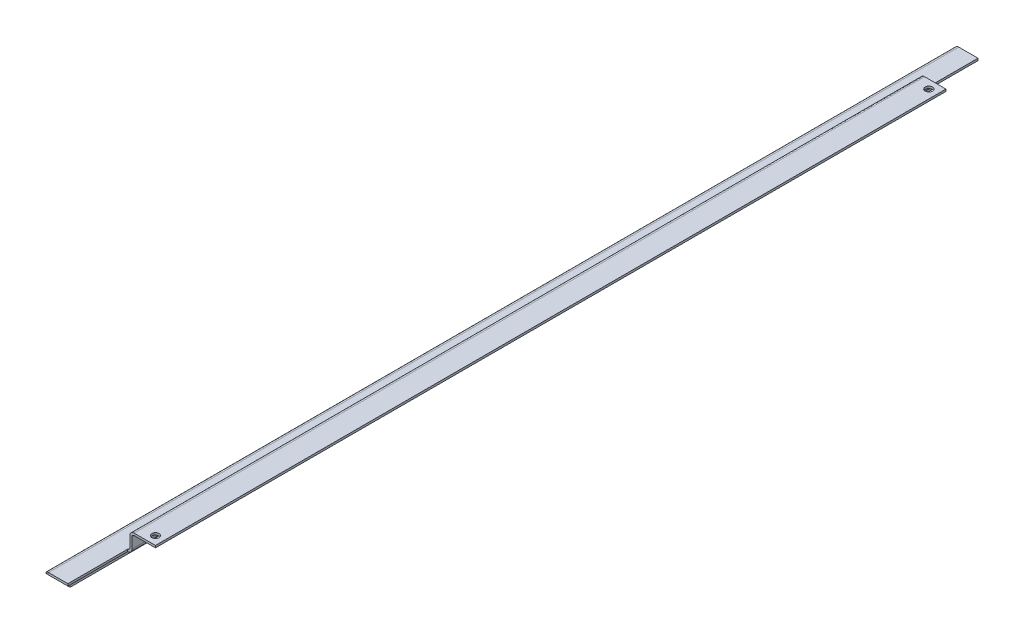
ISO-10303-21;
HEADER;
FILE_DESCRIPTION(('STEP AP214'),'2;1');
FILE_NAME('part.step','',(''),(''),'','','');
FILE_SCHEMA(('AUTOMOTIVE_DESIGN { 1 0 10303 214 1 1 1 1 }'));
ENDSEC;
DATA;
#1=APPLICATION_CONTEXT('core data for automotive mechanical design processes');
#2=APPLICATION_PROTOCOL_DEFINITION('international standard','automotive_design',2000,#1);
#3=PRODUCT_CONTEXT('',#1,'mechanical');
#4=PRODUCT('Part','Part','',(#3));
#5=PRODUCT_RELATED_PRODUCT_CATEGORY('part','',(#4));
#6=PRODUCT_DEFINITION_FORMATION('','',#4);
#7=PRODUCT_DEFINITION_CONTEXT('part definition',#1,'design');
#8=PRODUCT_DEFINITION('design','',#6,#7);
#9=PRODUCT_DEFINITION_SHAPE('','',#8);
#10=(LENGTH_UNIT() NAMED_UNIT(*) SI_UNIT(.MILLI.,.METRE.));
#11=(NAMED_UNIT(*) PLANE_ANGLE_UNIT() SI_UNIT($,.RADIAN.));
#12=(NAMED_UNIT(*) SI_UNIT($,.STERADIAN.) SOLID_ANGLE_UNIT());
#13=UNCERTAINTY_MEASURE_WITH_UNIT(LENGTH_MEASURE(1.E-05),#10,'distance_accuracy_value','');
#14=(GEOMETRIC_REPRESENTATION_CONTEXT(3) GLOBAL_UNCERTAINTY_ASSIGNED_CONTEXT((#13)) GLOBAL_UNIT_ASSIGNED_CONTEXT((#10,
#11,#12)) REPRESENTATION_CONTEXT('',''));
#15=CARTESIAN_POINT('',(0.,0.,0.));
#16=DIRECTION('',(0.,0.,1.));
#17=DIRECTION('',(1.,0.,0.));
#18=AXIS2_PLACEMENT_3D('',#15,#16,#17);
#19=CARTESIAN_POINT('',(5.,25.0000000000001,532.5));
#20=DIRECTION('',(0.,0.,-1.));
#21=DIRECTION('',(-1.,0.,0.));
#22=AXIS2_PLACEMENT_3D('',#19,#20,#21);
#23=CYLINDRICAL_SURFACE('',#22,5.);
#24=DIRECTION('',(0.,0.,-1.));
#25=VECTOR('',#24,1.);
#26=CARTESIAN_POINT('',(0.,25.0000000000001,532.5));
#27=LINE('',#26,#25);
#28=CARTESIAN_POINT('',(0.,25.0000000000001,530.));
#29=VERTEX_POINT('',#28);
#30=CARTESIAN_POINT('',(0.,25.0000000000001,-530.));
#31=VERTEX_POINT('',#30);
#32=EDGE_CURVE('E266',#29,#31,#27,.T.);
#33=ORIENTED_EDGE('',*,*,#32,.F.);
#34=CARTESIAN_POINT('',(5.,25.0000000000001,530.));
#35=DIRECTION('',(0.,0.44721359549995,-0.89442719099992));
#36=DIRECTION('',(0.,-0.89442719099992,-0.44721359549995));
#37=AXIS2_PLACEMENT_3D('',#34,#35,#36);
#38=ELLIPSE('',#37,5.59016994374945,5.);
#39=CARTESIAN_POINT('',(5.,30.,532.5));
#40=VERTEX_POINT('',#39);
#41=EDGE_CURVE('E333',#40,#29,#38,.F.);
#42=ORIENTED_EDGE('',*,*,#41,.F.);
#43=DIRECTION('',(0.,0.,-1.));
#44=VECTOR('',#43,1.);
#45=CARTESIAN_POINT('',(5.,30.,532.5));
#46=LINE('',#45,#44);
#47=CARTESIAN_POINT('',(5.,30.,-532.5));
#48=VERTEX_POINT('',#47);
#49=EDGE_CURVE('E269',#40,#48,#46,.T.);
#50=ORIENTED_EDGE('',*,*,#49,.T.);
#51=CARTESIAN_POINT('',(5.,24.9999999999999,-530.));
#52=DIRECTION('',(0.,0.44721359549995,0.89442719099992));
#53=DIRECTION('',(0.,0.89442719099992,-0.44721359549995));
#54=AXIS2_PLACEMENT_3D('',#51,#52,#53);
#55=ELLIPSE('',#54,5.59016994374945,5.);
#56=EDGE_CURVE('E354',#31,#48,#55,.F.);
#57=ORIENTED_EDGE('',*,*,#56,.F.);
#58=EDGE_LOOP('',(#33,#42,#50,#57));
#59=FACE_BOUND('',#58,.T.);
#60=ADVANCED_FACE('F42',(#59),#23,.T.);
#61=CARTESIAN_POINT('',(0.,0.,532.5));
#62=DIRECTION('',(-1.,0.,0.));
#63=DIRECTION('',(0.,0.,1.));
#64=AXIS2_PLACEMENT_3D('',#61,#62,#63);
#65=PLANE('',#64);
#66=DIRECTION('',(0.,0.,-1.));
#67=VECTOR('',#66,1.);
#68=CARTESIAN_POINT('',(0.,0.,532.5));
#69=LINE('',#68,#67);
#70=CARTESIAN_POINT('',(0.,0.,505.));
#71=VERTEX_POINT('',#70);
#72=CARTESIAN_POINT('',(0.,0.,-505.));
#73=VERTEX_POINT('',#72);
#74=EDGE_CURVE('E263',#71,#73,#69,.T.);
#75=ORIENTED_EDGE('',*,*,#74,.F.);
#76=DIRECTION('',(0.,-0.707106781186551,-0.707106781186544));
#77=VECTOR('',#76,1.);
#78=CARTESIAN_POINT('',(0.,13.7499999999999,518.75));
#79=LINE('',#78,#77);
#80=EDGE_CURVE('E339',#29,#71,#79,.T.);
#81=ORIENTED_EDGE('',*,*,#80,.F.);
#82=ORIENTED_EDGE('',*,*,#32,.T.);
#83=DIRECTION('',(0.,0.707106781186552,-0.707106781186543));
#84=VECTOR('',#83,1.);
#85=CARTESIAN_POINT('',(0.,0.,-505.));
#86=LINE('',#85,#84);
#87=EDGE_CURVE('E357',#73,#31,#86,.T.);
#88=ORIENTED_EDGE('',*,*,#87,.F.);
#89=EDGE_LOOP('',(#75,#81,#82,#88));
#90=FACE_BOUND('',#89,.T.);
#91=ADVANCED_FACE('F458',(#90),#65,.T.);
#92=CARTESIAN_POINT('',(2.49999999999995,0.,532.5));
#93=DIRECTION('',(0.,-1.,0.));
#94=DIRECTION('',(0.,0.,-1.));
#95=AXIS2_PLACEMENT_3D('',#92,#93,#94);
#96=PLANE('',#95);
#97=DIRECTION('',(0.,0.,-1.));
#98=VECTOR('',#97,1.);
#99=CARTESIAN_POINT('',(2.49999999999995,0.,532.5));
#100=LINE('',#99,#98);
#101=CARTESIAN_POINT('',(2.50000000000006,0.,505.));
#102=VERTEX_POINT('',#101);
#103=CARTESIAN_POINT('',(2.49999999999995,0.,-505.));
#104=VERTEX_POINT('',#103);
#105=EDGE_CURVE('E260',#102,#104,#100,.T.);
#106=ORIENTED_EDGE('',*,*,#105,.F.);
#107=DIRECTION('',(1.,0.,0.));
#108=VECTOR('',#107,1.);
#109=CARTESIAN_POINT('',(2.50000000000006,0.,505.));
#110=LINE('',#109,#108);
#111=EDGE_CURVE('E343',#102,#71,#110,.F.);
#112=ORIENTED_EDGE('',*,*,#111,.T.);
#113=ORIENTED_EDGE('',*,*,#74,.T.);
#114=DIRECTION('',(-1.,0.,0.));
#115=VECTOR('',#114,1.);
#116=CARTESIAN_POINT('',(0.,0.,-505.));
#117=LINE('',#116,#115);
#118=EDGE_CURVE('E364',#73,#104,#117,.F.);
#119=ORIENTED_EDGE('',*,*,#118,.T.);
#120=EDGE_LOOP('',(#106,#112,#113,#119));
#121=FACE_BOUND('',#120,.T.);
#122=ADVANCED_FACE('F455',(#121),#96,.T.);
#123=CARTESIAN_POINT('',(2.49999999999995,0.,532.5));
#124=DIRECTION('',(-1.,0.,0.));
#125=DIRECTION('',(0.,0.,1.));
#126=AXIS2_PLACEMENT_3D('',#123,#124,#125);
#127=PLANE('',#126);
#128=DIRECTION('',(0.,-0.707106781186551,-0.707106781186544));
#129=VECTOR('',#128,1.);
#130=CARTESIAN_POINT('',(2.49999999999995,13.7499999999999,518.75));
#131=LINE('',#130,#129);
#132=CARTESIAN_POINT('',(2.49999999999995,25.0000000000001,530.));
#133=VERTEX_POINT('',#132);
#134=EDGE_CURVE('E335',#133,#102,#131,.T.);
#135=ORIENTED_EDGE('',*,*,#134,.T.);
#136=ORIENTED_EDGE('',*,*,#105,.T.);
#137=DIRECTION('',(0.,0.707106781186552,-0.707106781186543));
#138=VECTOR('',#137,1.);
#139=CARTESIAN_POINT('',(2.49999999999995,0.,-505.));
#140=LINE('',#139,#138);
#141=CARTESIAN_POINT('',(2.49999999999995,24.9999999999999,-530.));
#142=VERTEX_POINT('',#141);
#143=EDGE_CURVE('E360',#104,#142,#140,.T.);
#144=ORIENTED_EDGE('',*,*,#143,.T.);
#145=DIRECTION('',(0.,0.,-1.));
#146=VECTOR('',#145,1.);
#147=CARTESIAN_POINT('',(2.49999999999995,25.0000000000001,532.5));
#148=LINE('',#147,#146);
#149=EDGE_CURVE('E257',#133,#142,#148,.T.);
#150=ORIENTED_EDGE('',*,*,#149,.F.);
#151=EDGE_LOOP('',(#135,#136,#144,#150));
#152=FACE_BOUND('',#151,.T.);
#153=ADVANCED_FACE('F451',(#152),#127,.F.);
#154=CARTESIAN_POINT('',(5.,25.0000000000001,532.5));
#155=DIRECTION('',(0.,0.,-1.));
#156=DIRECTION('',(-1.,0.,0.));
#157=AXIS2_PLACEMENT_3D('',#154,#155,#156);
#158=CYLINDRICAL_SURFACE('',#157,2.5);
#159=CARTESIAN_POINT('',(5.,25.0000000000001,530.));
#160=DIRECTION('',(0.,0.707106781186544,-0.707106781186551));
#161=DIRECTION('',(0.,-0.707106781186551,-0.707106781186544));
#162=AXIS2_PLACEMENT_3D('',#159,#160,#161);
#163=ELLIPSE('',#162,3.53553390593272,2.5);
#164=CARTESIAN_POINT('',(5.,27.5000000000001,532.5));
#165=VERTEX_POINT('',#164);
#166=EDGE_CURVE('E329',#165,#133,#163,.F.);
#167=ORIENTED_EDGE('',*,*,#166,.T.);
#168=ORIENTED_EDGE('',*,*,#149,.T.);
#169=CARTESIAN_POINT('',(5.,24.9999999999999,-530.));
#170=DIRECTION('',(0.,0.707106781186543,0.707106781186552));
#171=DIRECTION('',(0.,0.707106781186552,-0.707106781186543));
#172=AXIS2_PLACEMENT_3D('',#169,#170,#171);
#173=ELLIPSE('',#172,3.53553390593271,2.5);
#174=CARTESIAN_POINT('',(5.,27.4999999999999,-532.5));
#175=VERTEX_POINT('',#174);
#176=EDGE_CURVE('E347',#142,#175,#173,.F.);
#177=ORIENTED_EDGE('',*,*,#176,.T.);
#178=DIRECTION('',(0.,0.,-1.));
#179=VECTOR('',#178,1.);
#180=CARTESIAN_POINT('',(5.,27.5000000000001,532.5));
#181=LINE('',#180,#179);
#182=EDGE_CURVE('E252',#165,#175,#181,.T.);
#183=ORIENTED_EDGE('',*,*,#182,.F.);
#184=EDGE_LOOP('',(#167,#168,#177,#183));
#185=FACE_BOUND('',#184,.T.);
#186=ADVANCED_FACE('F438',(#185),#158,.F.);
#187=CARTESIAN_POINT('',(2.49999999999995,25.0000000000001,532.5));
#188=DIRECTION('',(0.,0.,1.));
#189=DIRECTION('',(1.,0.,0.));
#190=AXIS2_PLACEMENT_3D('',#187,#188,#189);
#191=PLANE('',#190);
#192=DIRECTION('',(1.,0.,0.));
#193=VECTOR('',#192,1.);
#194=CARTESIAN_POINT('',(0.,30.,532.5));
#195=LINE('',#194,#193);
#196=CARTESIAN_POINT('',(27.5,30.,532.5));
#197=VERTEX_POINT('',#196);
#198=EDGE_CURVE('E380',#40,#197,#195,.T.);
#199=ORIENTED_EDGE('',*,*,#198,.F.);
#200=DIRECTION('',(0.,-1.,0.));
#201=VECTOR('',#200,1.);
#202=CARTESIAN_POINT('',(5.,30.,532.5));
#203=LINE('',#202,#201);
#204=EDGE_CURVE('E217',#40,#165,#203,.T.);
#205=ORIENTED_EDGE('',*,*,#204,.T.);
#206=DIRECTION('',(1.,0.,0.));
#207=VECTOR('',#206,1.);
#208=CARTESIAN_POINT('',(0.,27.5000000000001,532.5));
#209=LINE('',#208,#207);
#210=CARTESIAN_POINT('',(27.5,27.5000000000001,532.5));
#211=VERTEX_POINT('',#210);
#212=EDGE_CURVE('E245',#165,#211,#209,.T.);
#213=ORIENTED_EDGE('',*,*,#212,.T.);
#214=DIRECTION('',(0.,1.,0.));
#215=VECTOR('',#214,1.);
#216=CARTESIAN_POINT('',(27.5,27.5000000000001,532.5));
#217=LINE('',#216,#215);
#218=EDGE_CURVE('E209',#211,#197,#217,.T.);
#219=ORIENTED_EDGE('',*,*,#218,.T.);
#220=EDGE_LOOP('',(#199,#205,#213,#219));
#221=FACE_BOUND('',#220,.T.);
#222=ADVANCED_FACE('F44',(#221),#191,.T.);
#223=CARTESIAN_POINT('',(32.5,32.5,-532.5));
#224=DIRECTION('',(0.,0.,-1.));
#225=DIRECTION('',(-1.,0.,0.));
#226=AXIS2_PLACEMENT_3D('',#223,#224,#225);
#227=PLANE('',#226);
#228=DIRECTION('',(1.,0.,0.));
#229=VECTOR('',#228,1.);
#230=CARTESIAN_POINT('',(0.,30.,-532.5));
#231=LINE('',#230,#229);
#232=CARTESIAN_POINT('',(27.5,30.,-532.5));
#233=VERTEX_POINT('',#232);
#234=EDGE_CURVE('E369',#48,#233,#231,.T.);
#235=ORIENTED_EDGE('',*,*,#234,.T.);
#236=DIRECTION('',(0.,-1.,0.));
#237=VECTOR('',#236,1.);
#238=CARTESIAN_POINT('',(27.5,30.,-532.5));
#239=LINE('',#238,#237);
#240=CARTESIAN_POINT('',(27.5,27.4999999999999,-532.5));
#241=VERTEX_POINT('',#240);
#242=EDGE_CURVE('E199',#233,#241,#239,.T.);
#243=ORIENTED_EDGE('',*,*,#242,.T.);
#244=DIRECTION('',(1.,0.,0.));
#245=VECTOR('',#244,1.);
#246=CARTESIAN_POINT('',(0.,27.4999999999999,-532.5));
#247=LINE('',#246,#245);
#248=EDGE_CURVE('E376',#175,#241,#247,.T.);
#249=ORIENTED_EDGE('',*,*,#248,.F.);
#250=DIRECTION('',(0.,1.,0.));
#251=VECTOR('',#250,1.);
#252=CARTESIAN_POINT('',(5.,27.4999999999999,-532.5));
#253=LINE('',#252,#251);
#254=EDGE_CURVE('E213',#175,#48,#253,.T.);
#255=ORIENTED_EDGE('',*,*,#254,.T.);
#256=EDGE_LOOP('',(#235,#243,#249,#255));
#257=FACE_BOUND('',#256,.T.);
#258=ADVANCED_FACE('F436',(#257),#227,.T.);
#259=CARTESIAN_POINT('',(30.,47.5000000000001,532.5));
#260=DIRECTION('',(0.,1.,0.));
#261=DIRECTION('',(0.,0.,1.));
#262=AXIS2_PLACEMENT_3D('',#259,#260,#261);
#263=PLANE('',#262);
#264=CARTESIAN_POINT('',(49.9999999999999,47.4999999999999,-452.5));
#265=DIRECTION('',(0.,1.,0.));
#266=DIRECTION('',(0.,0.,1.));
#267=AXIS2_PLACEMENT_3D('',#264,#265,#266);
#268=CIRCLE('',#267,4.24999999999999);
#269=CARTESIAN_POINT('',(49.9999999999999,47.4999999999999,-448.25));
#270=VERTEX_POINT('',#269);
#271=EDGE_CURVE('E423',#270,#270,#268,.T.);
#272=ORIENTED_EDGE('',*,*,#271,.T.);
#273=EDGE_LOOP('',(#272));
#274=FACE_BOUND('',#273,.T.);
#275=CARTESIAN_POINT('',(49.9999999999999,47.5000000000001,452.5));
#276=DIRECTION('',(0.,1.,0.));
#277=DIRECTION('',(0.,0.,1.));
#278=AXIS2_PLACEMENT_3D('',#275,#276,#277);
#279=CIRCLE('',#278,4.24999999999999);
#280=CARTESIAN_POINT('',(49.9999999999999,47.5000000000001,456.75));
#281=VERTEX_POINT('',#280);
#282=EDGE_CURVE('E188',#281,#281,#279,.T.);
#283=ORIENTED_EDGE('',*,*,#282,.T.);
#284=EDGE_LOOP('',(#283));
#285=FACE_BOUND('',#284,.T.);
#286=DIRECTION('',(0.,0.,-1.));
#287=VECTOR('',#286,1.);
#288=CARTESIAN_POINT('',(35.,47.5000000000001,532.5));
#289=LINE('',#288,#287);
#290=CARTESIAN_POINT('',(35.,47.5000000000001,462.5));
#291=VERTEX_POINT('',#290);
#292=CARTESIAN_POINT('',(35.,47.4999999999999,-462.5));
#293=VERTEX_POINT('',#292);
#294=EDGE_CURVE('E230',#291,#293,#289,.T.);
#295=ORIENTED_EDGE('',*,*,#294,.T.);
#296=DIRECTION('',(1.,0.,0.));
#297=VECTOR('',#296,1.);
#298=CARTESIAN_POINT('',(30.,47.4999999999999,-462.5));
#299=LINE('',#298,#297);
#300=CARTESIAN_POINT('',(59.9999999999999,47.4999999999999,-462.5));
#301=VERTEX_POINT('',#300);
#302=EDGE_CURVE('E58',#293,#301,#299,.T.);
#303=ORIENTED_EDGE('',*,*,#302,.T.);
#304=DIRECTION('',(0.,0.,-1.));
#305=VECTOR('',#304,1.);
#306=CARTESIAN_POINT('',(59.9999999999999,47.5000000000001,532.5));
#307=LINE('',#306,#305);
#308=CARTESIAN_POINT('',(59.9999999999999,47.5000000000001,462.5));
#309=VERTEX_POINT('',#308);
#310=EDGE_CURVE('E186',#309,#301,#307,.T.);
#311=ORIENTED_EDGE('',*,*,#310,.F.);
#312=DIRECTION('',(-1.,0.,0.));
#313=VECTOR('',#312,1.);
#314=CARTESIAN_POINT('',(30.,47.5000000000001,462.5));
#315=LINE('',#314,#313);
#316=EDGE_CURVE('E321',#309,#291,#315,.T.);
#317=ORIENTED_EDGE('',*,*,#316,.T.);
#318=EDGE_LOOP('',(#295,#303,#311,#317));
#319=FACE_BOUND('',#318,.T.);
#320=ADVANCED_FACE('F497',(#274,#285,#319),#263,.F.);
#321=CARTESIAN_POINT('',(59.9999999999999,50.,532.5));
#322=DIRECTION('',(1.,0.,0.));
#323=DIRECTION('',(0.,0.,-1.));
#324=AXIS2_PLACEMENT_3D('',#321,#322,#323);
#325=PLANE('',#324);
#326=DIRECTION('',(0.,-1.,0.));
#327=VECTOR('',#326,1.);
#328=CARTESIAN_POINT('',(59.9999999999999,50.,-462.5));
#329=LINE('',#328,#327);
#330=CARTESIAN_POINT('',(59.9999999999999,50.,-462.5));
#331=VERTEX_POINT('',#330);
#332=EDGE_CURVE('E168',#331,#301,#329,.T.);
#333=ORIENTED_EDGE('',*,*,#332,.F.);
#334=DIRECTION('',(0.,0.,-1.));
#335=VECTOR('',#334,1.);
#336=CARTESIAN_POINT('',(59.9999999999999,50.,532.5));
#337=LINE('',#336,#335);
#338=CARTESIAN_POINT('',(59.9999999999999,50.,462.5));
#339=VERTEX_POINT('',#338);
#340=EDGE_CURVE('E184',#339,#331,#337,.T.);
#341=ORIENTED_EDGE('',*,*,#340,.F.);
#342=DIRECTION('',(0.,1.,0.));
#343=VECTOR('',#342,1.);
#344=CARTESIAN_POINT('',(59.9999999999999,50.,462.5));
#345=LINE('',#344,#343);
#346=EDGE_CURVE('E302',#309,#339,#345,.T.);
#347=ORIENTED_EDGE('',*,*,#346,.F.);
#348=ORIENTED_EDGE('',*,*,#310,.T.);
#349=EDGE_LOOP('',(#333,#341,#347,#348));
#350=FACE_BOUND('',#349,.T.);
#351=ADVANCED_FACE('F182',(#350),#325,.T.);
#352=CARTESIAN_POINT('',(30.,50.,532.5));
#353=DIRECTION('',(0.,1.,0.));
#354=DIRECTION('',(0.,0.,1.));
#355=AXIS2_PLACEMENT_3D('',#352,#353,#354);
#356=PLANE('',#355);
#357=CARTESIAN_POINT('',(49.9999999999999,50.,-452.5));
#358=DIRECTION('',(0.,1.,0.));
#359=DIRECTION('',(0.,0.,1.));
#360=AXIS2_PLACEMENT_3D('',#357,#358,#359);
#361=CIRCLE('',#360,4.24999999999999);
#362=CARTESIAN_POINT('',(49.9999999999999,50.,-448.25));
#363=VERTEX_POINT('',#362);
#364=EDGE_CURVE('E426',#363,#363,#361,.T.);
#365=ORIENTED_EDGE('',*,*,#364,.F.);
#366=EDGE_LOOP('',(#365));
#367=FACE_BOUND('',#366,.T.);
#368=CARTESIAN_POINT('',(49.9999999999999,50.,452.5));
#369=DIRECTION('',(0.,1.,0.));
#370=DIRECTION('',(0.,0.,1.));
#371=AXIS2_PLACEMENT_3D('',#368,#369,#370);
#372=CIRCLE('',#371,4.24999999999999);
#373=CARTESIAN_POINT('',(49.9999999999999,50.,456.75));
#374=VERTEX_POINT('',#373);
#375=EDGE_CURVE('E425',#374,#374,#372,.T.);
#376=ORIENTED_EDGE('',*,*,#375,.F.);
#377=EDGE_LOOP('',(#376));
#378=FACE_BOUND('',#377,.T.);
#379=DIRECTION('',(1.,0.,0.));
#380=VECTOR('',#379,1.);
#381=CARTESIAN_POINT('',(27.5,50.,-462.5));
#382=LINE('',#381,#380);
#383=CARTESIAN_POINT('',(35.,50.,-462.5));
#384=VERTEX_POINT('',#383);
#385=EDGE_CURVE('E165',#384,#331,#382,.T.);
#386=ORIENTED_EDGE('',*,*,#385,.F.);
#387=DIRECTION('',(0.,0.,-1.));
#388=VECTOR('',#387,1.);
#389=CARTESIAN_POINT('',(35.,50.,532.5));
#390=LINE('',#389,#388);
#391=CARTESIAN_POINT('',(35.,50.,462.5));
#392=VERTEX_POINT('',#391);
#393=EDGE_CURVE('E194',#392,#384,#390,.T.);
#394=ORIENTED_EDGE('',*,*,#393,.F.);
#395=DIRECTION('',(1.,0.,0.));
#396=VECTOR('',#395,1.);
#397=CARTESIAN_POINT('',(27.5,50.,462.5));
#398=LINE('',#397,#396);
#399=EDGE_CURVE('E192',#392,#339,#398,.T.);
#400=ORIENTED_EDGE('',*,*,#399,.T.);
#401=ORIENTED_EDGE('',*,*,#340,.T.);
#402=EDGE_LOOP('',(#386,#394,#400,#401));
#403=FACE_BOUND('',#402,.T.);
#404=ADVANCED_FACE('F191',(#367,#378,#403),#356,.T.);
#405=CARTESIAN_POINT('',(35.,45.0000000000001,532.5));
#406=DIRECTION('',(0.,0.,-1.));
#407=DIRECTION('',(-1.,0.,0.));
#408=AXIS2_PLACEMENT_3D('',#405,#406,#407);
#409=CYLINDRICAL_SURFACE('',#408,5.);
#410=CARTESIAN_POINT('',(35.,44.9999999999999,-462.5));
#411=DIRECTION('',(0.,0.,1.));
#412=DIRECTION('',(1.,0.,0.));
#413=AXIS2_PLACEMENT_3D('',#410,#411,#412);
#414=CIRCLE('',#413,5.);
#415=CARTESIAN_POINT('',(30.,44.9999999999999,-462.5));
#416=VERTEX_POINT('',#415);
#417=EDGE_CURVE('E170',#416,#384,#414,.F.);
#418=ORIENTED_EDGE('',*,*,#417,.F.);
#419=DIRECTION('',(0.,0.,-1.));
#420=VECTOR('',#419,1.);
#421=CARTESIAN_POINT('',(30.,45.0000000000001,532.5));
#422=LINE('',#421,#420);
#423=CARTESIAN_POINT('',(30.,45.0000000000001,462.5));
#424=VERTEX_POINT('',#423);
#425=EDGE_CURVE('E202',#424,#416,#422,.T.);
#426=ORIENTED_EDGE('',*,*,#425,.F.);
#427=CARTESIAN_POINT('',(35.,45.0000000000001,462.5));
#428=DIRECTION('',(0.,0.,-1.));
#429=DIRECTION('',(-1.,0.,0.));
#430=AXIS2_PLACEMENT_3D('',#427,#428,#429);
#431=CIRCLE('',#430,5.);
#432=EDGE_CURVE('E296',#392,#424,#431,.F.);
#433=ORIENTED_EDGE('',*,*,#432,.F.);
#434=ORIENTED_EDGE('',*,*,#393,.T.);
#435=EDGE_LOOP('',(#418,#426,#433,#434));
#436=FACE_BOUND('',#435,.T.);
#437=ADVANCED_FACE('F295',(#436),#409,.T.);
#438=CARTESIAN_POINT('',(30.,30.,532.5));
#439=DIRECTION('',(-1.,0.,0.));
#440=DIRECTION('',(0.,0.,1.));
#441=AXIS2_PLACEMENT_3D('',#438,#439,#440);
#442=PLANE('',#441);
#443=DIRECTION('',(0.,1.,0.));
#444=VECTOR('',#443,1.);
#445=CARTESIAN_POINT('',(30.,30.,-462.5));
#446=LINE('',#445,#444);
#447=CARTESIAN_POINT('',(30.,32.5,-462.5));
#448=VERTEX_POINT('',#447);
#449=EDGE_CURVE('E291',#448,#416,#446,.T.);
#450=ORIENTED_EDGE('',*,*,#449,.F.);
#451=DIRECTION('',(0.,0.,-1.));
#452=VECTOR('',#451,1.);
#453=CARTESIAN_POINT('',(30.,32.5,532.5));
#454=LINE('',#453,#452);
#455=CARTESIAN_POINT('',(30.,32.5,462.5));
#456=VERTEX_POINT('',#455);
#457=EDGE_CURVE('E278',#456,#448,#454,.T.);
#458=ORIENTED_EDGE('',*,*,#457,.F.);
#459=DIRECTION('',(0.,-1.,0.));
#460=VECTOR('',#459,1.);
#461=CARTESIAN_POINT('',(30.,30.,462.5));
#462=LINE('',#461,#460);
#463=EDGE_CURVE('E292',#424,#456,#462,.T.);
#464=ORIENTED_EDGE('',*,*,#463,.F.);
#465=ORIENTED_EDGE('',*,*,#425,.T.);
#466=EDGE_LOOP('',(#450,#458,#464,#465));
#467=FACE_BOUND('',#466,.T.);
#468=ADVANCED_FACE('F289',(#467),#442,.T.);
#469=CARTESIAN_POINT('',(27.5,32.5,532.5));
#470=DIRECTION('',(0.,0.,-1.));
#471=DIRECTION('',(-1.,0.,0.));
#472=AXIS2_PLACEMENT_3D('',#469,#470,#471);
#473=CYLINDRICAL_SURFACE('',#472,2.5);
#474=CARTESIAN_POINT('',(27.5,32.5,-462.5));
#475=DIRECTION('',(0.,0.,1.));
#476=DIRECTION('',(1.,0.,0.));
#477=AXIS2_PLACEMENT_3D('',#474,#475,#476);
#478=CIRCLE('',#477,2.5);
#479=CARTESIAN_POINT('',(27.5,30.,-462.5));
#480=VERTEX_POINT('',#479);
#481=EDGE_CURVE('E304',#480,#448,#478,.T.);
#482=ORIENTED_EDGE('',*,*,#481,.F.);
#483=DIRECTION('',(0.,0.,-1.));
#484=VECTOR('',#483,1.);
#485=CARTESIAN_POINT('',(27.5,30.,532.5));
#486=LINE('',#485,#484);
#487=CARTESIAN_POINT('',(27.5,30.,462.5));
#488=VERTEX_POINT('',#487);
#489=EDGE_CURVE('E273',#488,#480,#486,.T.);
#490=ORIENTED_EDGE('',*,*,#489,.F.);
#491=CARTESIAN_POINT('',(27.5,32.5,462.5));
#492=DIRECTION('',(0.,0.,-1.));
#493=DIRECTION('',(-1.,0.,0.));
#494=AXIS2_PLACEMENT_3D('',#491,#492,#493);
#495=CIRCLE('',#494,2.5);
#496=EDGE_CURVE('E323',#456,#488,#495,.T.);
#497=ORIENTED_EDGE('',*,*,#496,.F.);
#498=ORIENTED_EDGE('',*,*,#457,.T.);
#499=EDGE_LOOP('',(#482,#490,#497,#498));
#500=FACE_BOUND('',#499,.T.);
#501=ADVANCED_FACE('F416',(#500),#473,.F.);
#502=CARTESIAN_POINT('',(0.,30.,532.5));
#503=DIRECTION('',(0.,1.,0.));
#504=DIRECTION('',(0.,0.,1.));
#505=AXIS2_PLACEMENT_3D('',#502,#503,#504);
#506=PLANE('',#505);
#507=ORIENTED_EDGE('',*,*,#234,.F.);
#508=ORIENTED_EDGE('',*,*,#49,.F.);
#509=ORIENTED_EDGE('',*,*,#198,.T.);
#510=EDGE_CURVE('E274',#197,#488,#486,.T.);
#511=ORIENTED_EDGE('',*,*,#510,.T.);
#512=ORIENTED_EDGE('',*,*,#489,.T.);
#513=DIRECTION('',(0.,0.,1.));
#514=VECTOR('',#513,1.);
#515=CARTESIAN_POINT('',(27.5,30.,532.5));
#516=LINE('',#515,#514);
#517=EDGE_CURVE('E298',#233,#480,#516,.T.);
#518=ORIENTED_EDGE('',*,*,#517,.F.);
#519=EDGE_LOOP('',(#507,#508,#509,#511,#512,#518));
#520=FACE_BOUND('',#519,.T.);
#521=ADVANCED_FACE('F420',(#520),#506,.T.);
#522=CARTESIAN_POINT('',(0.,27.5000000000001,532.5));
#523=DIRECTION('',(0.,1.,0.));
#524=DIRECTION('',(0.,0.,1.));
#525=AXIS2_PLACEMENT_3D('',#522,#523,#524);
#526=PLANE('',#525);
#527=ORIENTED_EDGE('',*,*,#248,.T.);
#528=DIRECTION('',(0.,0.,-1.));
#529=VECTOR('',#528,1.);
#530=CARTESIAN_POINT('',(27.5,27.5000000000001,532.5));
#531=LINE('',#530,#529);
#532=CARTESIAN_POINT('',(27.5,27.5000000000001,-462.5));
#533=VERTEX_POINT('',#532);
#534=EDGE_CURVE('E242',#533,#241,#531,.T.);
#535=ORIENTED_EDGE('',*,*,#534,.F.);
#536=CARTESIAN_POINT('',(27.5,27.5000000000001,462.5));
#537=VERTEX_POINT('',#536);
#538=EDGE_CURVE('E253',#537,#533,#531,.T.);
#539=ORIENTED_EDGE('',*,*,#538,.F.);
#540=EDGE_CURVE('E249',#211,#537,#531,.T.);
#541=ORIENTED_EDGE('',*,*,#540,.F.);
#542=ORIENTED_EDGE('',*,*,#212,.F.);
#543=ORIENTED_EDGE('',*,*,#182,.T.);
#544=EDGE_LOOP('',(#527,#535,#539,#541,#542,#543));
#545=FACE_BOUND('',#544,.T.);
#546=ADVANCED_FACE('F391',(#545),#526,.F.);
#547=CARTESIAN_POINT('',(27.5,32.5,532.5));
#548=DIRECTION('',(0.,0.,-1.));
#549=DIRECTION('',(-1.,0.,0.));
#550=AXIS2_PLACEMENT_3D('',#547,#548,#549);
#551=CYLINDRICAL_SURFACE('',#550,5.);
#552=ORIENTED_EDGE('',*,*,#538,.T.);
#553=CARTESIAN_POINT('',(27.5,32.5,-462.5));
#554=DIRECTION('',(0.,0.,1.));
#555=DIRECTION('',(1.,0.,0.));
#556=AXIS2_PLACEMENT_3D('',#553,#554,#555);
#557=CIRCLE('',#556,5.);
#558=CARTESIAN_POINT('',(32.5,32.5,-462.5));
#559=VERTEX_POINT('',#558);
#560=EDGE_CURVE('E403',#533,#559,#557,.T.);
#561=ORIENTED_EDGE('',*,*,#560,.T.);
#562=DIRECTION('',(0.,0.,-1.));
#563=VECTOR('',#562,1.);
#564=CARTESIAN_POINT('',(32.5,32.5,532.5));
#565=LINE('',#564,#563);
#566=CARTESIAN_POINT('',(32.5,32.5,462.5));
#567=VERTEX_POINT('',#566);
#568=EDGE_CURVE('E238',#567,#559,#565,.T.);
#569=ORIENTED_EDGE('',*,*,#568,.F.);
#570=CARTESIAN_POINT('',(27.5,32.5,462.5));
#571=DIRECTION('',(0.,0.,-1.));
#572=DIRECTION('',(-1.,0.,0.));
#573=AXIS2_PLACEMENT_3D('',#570,#571,#572);
#574=CIRCLE('',#573,5.);
#575=EDGE_CURVE('E317',#567,#537,#574,.T.);
#576=ORIENTED_EDGE('',*,*,#575,.T.);
#577=EDGE_LOOP('',(#552,#561,#569,#576));
#578=FACE_BOUND('',#577,.T.);
#579=ADVANCED_FACE('F401',(#578),#551,.T.);
#580=CARTESIAN_POINT('',(32.5,30.,532.5));
#581=DIRECTION('',(-1.,0.,0.));
#582=DIRECTION('',(0.,0.,1.));
#583=AXIS2_PLACEMENT_3D('',#580,#581,#582);
#584=PLANE('',#583);
#585=ORIENTED_EDGE('',*,*,#568,.T.);
#586=DIRECTION('',(0.,1.,0.));
#587=VECTOR('',#586,1.);
#588=CARTESIAN_POINT('',(32.5,30.,-462.5));
#589=LINE('',#588,#587);
#590=CARTESIAN_POINT('',(32.5,44.9999999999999,-462.5));
#591=VERTEX_POINT('',#590);
#592=EDGE_CURVE('E176',#559,#591,#589,.T.);
#593=ORIENTED_EDGE('',*,*,#592,.T.);
#594=DIRECTION('',(0.,0.,-1.));
#595=VECTOR('',#594,1.);
#596=CARTESIAN_POINT('',(32.5,45.0000000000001,532.5));
#597=LINE('',#596,#595);
#598=CARTESIAN_POINT('',(32.5,45.0000000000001,462.5));
#599=VERTEX_POINT('',#598);
#600=EDGE_CURVE('E228',#599,#591,#597,.T.);
#601=ORIENTED_EDGE('',*,*,#600,.F.);
#602=DIRECTION('',(0.,-1.,0.));
#603=VECTOR('',#602,1.);
#604=CARTESIAN_POINT('',(32.5,30.,462.5));
#605=LINE('',#604,#603);
#606=EDGE_CURVE('E65',#599,#567,#605,.T.);
#607=ORIENTED_EDGE('',*,*,#606,.T.);
#608=EDGE_LOOP('',(#585,#593,#601,#607));
#609=FACE_BOUND('',#608,.T.);
#610=ADVANCED_FACE('F235',(#609),#584,.F.);
#611=CARTESIAN_POINT('',(35.,45.0000000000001,532.5));
#612=DIRECTION('',(0.,0.,-1.));
#613=DIRECTION('',(-1.,0.,0.));
#614=AXIS2_PLACEMENT_3D('',#611,#612,#613);
#615=CYLINDRICAL_SURFACE('',#614,2.5);
#616=ORIENTED_EDGE('',*,*,#600,.T.);
#617=CARTESIAN_POINT('',(35.,44.9999999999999,-462.5));
#618=DIRECTION('',(0.,0.,1.));
#619=DIRECTION('',(1.,0.,0.));
#620=AXIS2_PLACEMENT_3D('',#617,#618,#619);
#621=CIRCLE('',#620,2.5);
#622=EDGE_CURVE('E11',#591,#293,#621,.F.);
#623=ORIENTED_EDGE('',*,*,#622,.T.);
#624=ORIENTED_EDGE('',*,*,#294,.F.);
#625=CARTESIAN_POINT('',(35.,45.0000000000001,462.5));
#626=DIRECTION('',(0.,0.,-1.));
#627=DIRECTION('',(-1.,0.,0.));
#628=AXIS2_PLACEMENT_3D('',#625,#626,#627);
#629=CIRCLE('',#628,2.5);
#630=EDGE_CURVE('E51',#291,#599,#629,.F.);
#631=ORIENTED_EDGE('',*,*,#630,.T.);
#632=EDGE_LOOP('',(#616,#623,#624,#631));
#633=FACE_BOUND('',#632,.T.);
#634=ADVANCED_FACE('F227',(#633),#615,.F.);
#635=CARTESIAN_POINT('',(0.,0.,-505.));
#636=DIRECTION('',(0.,0.707106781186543,0.707106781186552));
#637=DIRECTION('',(0.,0.707106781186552,-0.707106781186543));
#638=AXIS2_PLACEMENT_3D('',#635,#636,#637);
#639=PLANE('',#638);
#640=ORIENTED_EDGE('',*,*,#87,.T.);
#641=DIRECTION('',(-1.,0.,0.));
#642=VECTOR('',#641,1.);
#643=CARTESIAN_POINT('',(0.,25.0000000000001,-530.));
#644=LINE('',#643,#642);
#645=EDGE_CURVE('E365',#31,#142,#644,.F.);
#646=ORIENTED_EDGE('',*,*,#645,.T.);
#647=ORIENTED_EDGE('',*,*,#143,.F.);
#648=ORIENTED_EDGE('',*,*,#118,.F.);
#649=EDGE_LOOP('',(#640,#646,#647,#648));
#650=FACE_BOUND('',#649,.T.);
#651=ADVANCED_FACE('F447',(#650),#639,.F.);
#652=CARTESIAN_POINT('',(5.,30.,-532.5));
#653=CARTESIAN_POINT('',(5.,29.1666666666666,-532.5));
#654=CARTESIAN_POINT('',(5.,28.3333333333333,-532.5));
#655=CARTESIAN_POINT('',(5.,27.4999999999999,-532.5));
#656=CARTESIAN_POINT('',(15.,30.,-532.5));
#657=CARTESIAN_POINT('',(13.3333333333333,29.1666666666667,-532.5));
#658=CARTESIAN_POINT('',(11.6666666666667,28.3333333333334,-532.5));
#659=CARTESIAN_POINT('',(9.99999999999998,27.5,-532.5));
#660=CARTESIAN_POINT('',(15.,20.,-527.5));
#661=CARTESIAN_POINT('',(13.3333333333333,20.8333333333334,-527.5));
#662=CARTESIAN_POINT('',(11.6666666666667,21.6666666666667,-527.5));
#663=CARTESIAN_POINT('',(9.99999999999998,22.5,-527.5));
#664=CARTESIAN_POINT('',(5.,20.,-527.5));
#665=CARTESIAN_POINT('',(5.,20.8333333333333,-527.5));
#666=CARTESIAN_POINT('',(5.,21.6666666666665,-527.5));
#667=CARTESIAN_POINT('',(5.,22.5,-527.5));
#668=CARTESIAN_POINT('',(-5.00000000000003,20.,-527.5));
#669=CARTESIAN_POINT('',(-3.33333333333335,20.8333333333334,-527.5));
#670=CARTESIAN_POINT('',(-1.66666666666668,21.6666666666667,-527.5));
#671=CARTESIAN_POINT('',(0.,22.5,-527.5));
#672=CARTESIAN_POINT('',(-5.00000000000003,30.,-532.5));
#673=CARTESIAN_POINT('',(-3.33333333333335,29.1666666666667,-532.5));
#674=CARTESIAN_POINT('',(-1.66666666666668,28.3333333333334,-532.5));
#675=CARTESIAN_POINT('',(0.,27.5,-532.5));
#676=CARTESIAN_POINT('',(5.,30.,-532.5));
#677=CARTESIAN_POINT('',(5.,29.1666666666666,-532.5));
#678=CARTESIAN_POINT('',(5.,28.3333333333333,-532.5));
#679=CARTESIAN_POINT('',(5.,27.4999999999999,-532.5));
#680=(BOUNDED_SURFACE() B_SPLINE_SURFACE(3,3,((#652,#653,#654,#655),(#656,#657,#658,#659),(#660,
#661,#662,#663),(#664,#665,#666,#667),(#668,#669,#670,#671),(#672,#673,#674,#675),(#676,#677,
#678,#679)),.UNSPECIFIED.,.T.,.F.,.F.) B_SPLINE_SURFACE_WITH_KNOTS((4,3,4),(4,4),(0.,0.5,1.),
(0.,1.),.UNSPECIFIED.) GEOMETRIC_REPRESENTATION_ITEM() RATIONAL_B_SPLINE_SURFACE(((1.,1.,1.,1.),
(0.333333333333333,0.333333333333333,0.333333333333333,0.333333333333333),(0.333333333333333,
0.333333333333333,0.333333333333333,0.333333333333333),(1.,1.,1.,1.),(0.333333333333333,
0.333333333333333,0.333333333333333,0.333333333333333),(0.333333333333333,0.333333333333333,
0.333333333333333,0.333333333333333),(1.,1.,1.,1.))) REPRESENTATION_ITEM('') SURFACE());
#681=ORIENTED_EDGE('',*,*,#254,.F.);
#682=ORIENTED_EDGE('',*,*,#176,.F.);
#683=ORIENTED_EDGE('',*,*,#645,.F.);
#684=ORIENTED_EDGE('',*,*,#56,.T.);
#685=EDGE_LOOP('',(#681,#682,#683,#684));
#686=FACE_BOUND('',#685,.T.);
#687=ADVANCED_FACE('F443',(#686),#680,.T.);
#688=CARTESIAN_POINT('',(2.49999999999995,13.7499999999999,518.75));
#689=DIRECTION('',(0.,0.707106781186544,-0.707106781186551));
#690=DIRECTION('',(0.,-0.707106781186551,-0.707106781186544));
#691=AXIS2_PLACEMENT_3D('',#688,#689,#690);
#692=PLANE('',#691);
#693=ORIENTED_EDGE('',*,*,#111,.F.);
#694=ORIENTED_EDGE('',*,*,#134,.F.);
#695=DIRECTION('',(1.,0.,0.));
#696=VECTOR('',#695,1.);
#697=CARTESIAN_POINT('',(2.49999999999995,25.0000000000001,530.));
#698=LINE('',#697,#696);
#699=EDGE_CURVE('E342',#133,#29,#698,.F.);
#700=ORIENTED_EDGE('',*,*,#699,.T.);
#701=ORIENTED_EDGE('',*,*,#80,.T.);
#702=EDGE_LOOP('',(#693,#694,#700,#701));
#703=FACE_BOUND('',#702,.T.);
#704=ADVANCED_FACE('F467',(#703),#692,.F.);
#705=CARTESIAN_POINT('',(5.,20.,527.5));
#706=CARTESIAN_POINT('',(5.,20.8333333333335,527.5));
#707=CARTESIAN_POINT('',(5.,21.6666666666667,527.5));
#708=CARTESIAN_POINT('',(5.,22.5,527.5));
#709=CARTESIAN_POINT('',(15.,20.,527.5));
#710=CARTESIAN_POINT('',(13.3333333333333,20.8333333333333,527.5));
#711=CARTESIAN_POINT('',(11.6666666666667,21.6666666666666,527.5));
#712=CARTESIAN_POINT('',(9.99999999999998,22.5,527.5));
#713=CARTESIAN_POINT('',(15.,30.,532.5));
#714=CARTESIAN_POINT('',(13.3333333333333,29.1666666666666,532.5));
#715=CARTESIAN_POINT('',(11.6666666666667,28.3333333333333,532.5));
#716=CARTESIAN_POINT('',(9.99999999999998,27.5,532.5));
#717=CARTESIAN_POINT('',(5.,30.,532.5));
#718=CARTESIAN_POINT('',(5.,29.1666666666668,532.5));
#719=CARTESIAN_POINT('',(5.,28.3333333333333,532.5));
#720=CARTESIAN_POINT('',(5.,27.5000000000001,532.5));
#721=CARTESIAN_POINT('',(-5.00000000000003,30.,532.5));
#722=CARTESIAN_POINT('',(-3.33333333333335,29.1666666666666,532.5));
#723=CARTESIAN_POINT('',(-1.66666666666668,28.3333333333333,532.5));
#724=CARTESIAN_POINT('',(0.,27.5,532.5));
#725=CARTESIAN_POINT('',(-5.00000000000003,20.,527.5));
#726=CARTESIAN_POINT('',(-3.33333333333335,20.8333333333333,527.5));
#727=CARTESIAN_POINT('',(-1.66666666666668,21.6666666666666,527.5));
#728=CARTESIAN_POINT('',(0.,22.5,527.5));
#729=CARTESIAN_POINT('',(5.,20.,527.5));
#730=CARTESIAN_POINT('',(5.,20.8333333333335,527.5));
#731=CARTESIAN_POINT('',(5.,21.6666666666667,527.5));
#732=CARTESIAN_POINT('',(5.,22.5,527.5));
#733=(BOUNDED_SURFACE() B_SPLINE_SURFACE(3,3,((#705,#706,#707,#708),(#709,#710,#711,#712),(#713,
#714,#715,#716),(#717,#718,#719,#720),(#721,#722,#723,#724),(#725,#726,#727,#728),(#729,#730,
#731,#732)),.UNSPECIFIED.,.T.,.F.,.F.) B_SPLINE_SURFACE_WITH_KNOTS((4,3,4),(4,4),(0.,0.5,1.),
(0.,1.),.UNSPECIFIED.) GEOMETRIC_REPRESENTATION_ITEM() RATIONAL_B_SPLINE_SURFACE(((1.,1.,1.,1.),
(0.333333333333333,0.333333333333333,0.333333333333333,0.333333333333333),(0.333333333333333,
0.333333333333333,0.333333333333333,0.333333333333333),(1.,1.,1.,1.),(0.333333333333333,
0.333333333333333,0.333333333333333,0.333333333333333),(0.333333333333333,0.333333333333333,
0.333333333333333,0.333333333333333),(1.,1.,1.,1.))) REPRESENTATION_ITEM('') SURFACE());
#734=ORIENTED_EDGE('',*,*,#699,.F.);
#735=ORIENTED_EDGE('',*,*,#166,.F.);
#736=ORIENTED_EDGE('',*,*,#204,.F.);
#737=ORIENTED_EDGE('',*,*,#41,.T.);
#738=EDGE_LOOP('',(#734,#735,#736,#737));
#739=FACE_BOUND('',#738,.T.);
#740=ADVANCED_FACE('F465',(#739),#733,.T.);
#741=CARTESIAN_POINT('',(27.5,25.0000000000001,532.5));
#742=DIRECTION('',(1.,0.,0.));
#743=DIRECTION('',(0.,0.,-1.));
#744=AXIS2_PLACEMENT_3D('',#741,#742,#743);
#745=PLANE('',#744);
#746=ORIENTED_EDGE('',*,*,#218,.F.);
#747=ORIENTED_EDGE('',*,*,#540,.T.);
#748=DIRECTION('',(0.,1.,0.));
#749=VECTOR('',#748,1.);
#750=CARTESIAN_POINT('',(27.5,50.,462.5));
#751=LINE('',#750,#749);
#752=EDGE_CURVE('E310',#537,#488,#751,.T.);
#753=ORIENTED_EDGE('',*,*,#752,.T.);
#754=ORIENTED_EDGE('',*,*,#510,.F.);
#755=EDGE_LOOP('',(#746,#747,#753,#754));
#756=FACE_BOUND('',#755,.T.);
#757=ADVANCED_FACE('F396',(#756),#745,.T.);
#758=CARTESIAN_POINT('',(27.5,50.,462.5));
#759=DIRECTION('',(0.,0.,-1.));
#760=DIRECTION('',(-1.,0.,0.));
#761=AXIS2_PLACEMENT_3D('',#758,#759,#760);
#762=PLANE('',#761);
#763=ORIENTED_EDGE('',*,*,#432,.T.);
#764=ORIENTED_EDGE('',*,*,#463,.T.);
#765=ORIENTED_EDGE('',*,*,#496,.T.);
#766=ORIENTED_EDGE('',*,*,#752,.F.);
#767=ORIENTED_EDGE('',*,*,#575,.F.);
#768=ORIENTED_EDGE('',*,*,#606,.F.);
#769=ORIENTED_EDGE('',*,*,#630,.F.);
#770=ORIENTED_EDGE('',*,*,#316,.F.);
#771=ORIENTED_EDGE('',*,*,#346,.T.);
#772=ORIENTED_EDGE('',*,*,#399,.F.);
#773=EDGE_LOOP('',(#763,#764,#765,#766,#767,#768,#769,#770,#771,#772));
#774=FACE_BOUND('',#773,.T.);
#775=ADVANCED_FACE('F398',(#774),#762,.F.);
#776=CARTESIAN_POINT('',(27.5,24.9999999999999,-532.5));
#777=DIRECTION('',(-1.,0.,0.));
#778=DIRECTION('',(0.,0.,1.));
#779=AXIS2_PLACEMENT_3D('',#776,#777,#778);
#780=PLANE('',#779);
#781=ORIENTED_EDGE('',*,*,#517,.T.);
#782=DIRECTION('',(0.,-1.,0.));
#783=VECTOR('',#782,1.);
#784=CARTESIAN_POINT('',(27.5,50.,-462.5));
#785=LINE('',#784,#783);
#786=EDGE_CURVE('E177',#480,#533,#785,.T.);
#787=ORIENTED_EDGE('',*,*,#786,.T.);
#788=ORIENTED_EDGE('',*,*,#534,.T.);
#789=ORIENTED_EDGE('',*,*,#242,.F.);
#790=EDGE_LOOP('',(#781,#787,#788,#789));
#791=FACE_BOUND('',#790,.T.);
#792=ADVANCED_FACE('F433',(#791),#780,.F.);
#793=CARTESIAN_POINT('',(27.5,50.,-462.5));
#794=DIRECTION('',(0.,0.,1.));
#795=DIRECTION('',(1.,0.,0.));
#796=AXIS2_PLACEMENT_3D('',#793,#794,#795);
#797=PLANE('',#796);
#798=ORIENTED_EDGE('',*,*,#417,.T.);
#799=ORIENTED_EDGE('',*,*,#385,.T.);
#800=ORIENTED_EDGE('',*,*,#332,.T.);
#801=ORIENTED_EDGE('',*,*,#302,.F.);
#802=ORIENTED_EDGE('',*,*,#622,.F.);
#803=ORIENTED_EDGE('',*,*,#592,.F.);
#804=ORIENTED_EDGE('',*,*,#560,.F.);
#805=ORIENTED_EDGE('',*,*,#786,.F.);
#806=ORIENTED_EDGE('',*,*,#481,.T.);
#807=ORIENTED_EDGE('',*,*,#449,.T.);
#808=EDGE_LOOP('',(#798,#799,#800,#801,#802,#803,#804,#805,#806,#807));
#809=FACE_BOUND('',#808,.T.);
#810=ADVANCED_FACE('F167',(#809),#797,.F.);
#811=CARTESIAN_POINT('',(49.9999999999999,50.,452.5));
#812=DIRECTION('',(0.,1.,0.));
#813=DIRECTION('',(0.,0.,1.));
#814=AXIS2_PLACEMENT_3D('',#811,#812,#813);
#815=CYLINDRICAL_SURFACE('',#814,4.24999999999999);
#816=ORIENTED_EDGE('',*,*,#375,.T.);
#817=EDGE_LOOP('',(#816));
#818=FACE_BOUND('',#817,.T.);
#819=ORIENTED_EDGE('',*,*,#282,.F.);
#820=EDGE_LOOP('',(#819));
#821=FACE_BOUND('',#820,.T.);
#822=ADVANCED_FACE('F640',(#818,#821),#815,.F.);
#823=CARTESIAN_POINT('',(49.9999999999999,50.,-452.5));
#824=DIRECTION('',(0.,1.,0.));
#825=DIRECTION('',(0.,0.,1.));
#826=AXIS2_PLACEMENT_3D('',#823,#824,#825);
#827=CYLINDRICAL_SURFACE('',#826,4.24999999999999);
#828=ORIENTED_EDGE('',*,*,#364,.T.);
#829=EDGE_LOOP('',(#828));
#830=FACE_BOUND('',#829,.T.);
#831=ORIENTED_EDGE('',*,*,#271,.F.);
#832=EDGE_LOOP('',(#831));
#833=FACE_BOUND('',#832,.T.);
#834=ADVANCED_FACE('F648',(#830,#833),#827,.F.);
#835=CLOSED_SHELL('',(#60,#91,#122,#153,#186,#222,#258,#320,#351,#404,#437,#468,#501,#521,#546,
#579,#610,#634,#651,#687,#704,#740,#757,#775,#792,#810,#822,#834));
#836=MANIFOLD_SOLID_BREP('B2',#835);
#837=ADVANCED_BREP_SHAPE_REPRESENTATION('',(#18,#836),#14);
#838=SHAPE_DEFINITION_REPRESENTATION(#9,#837);
ENDSEC;
END-ISO-10303-21;
